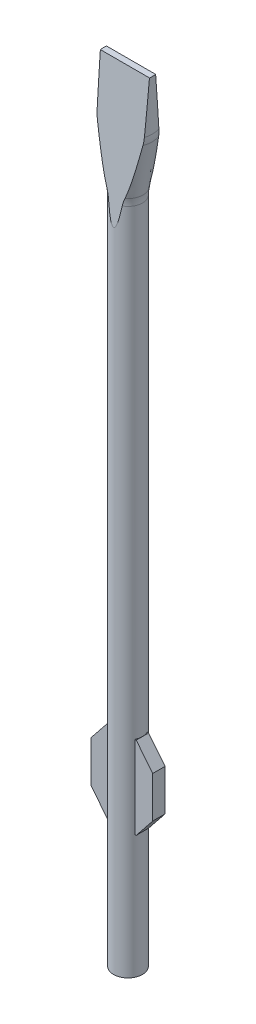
ISO-10303-21;
HEADER;
FILE_DESCRIPTION(('STEP AP214'),'2;1');
FILE_NAME('part.step','',(''),(''),'','','');
FILE_SCHEMA(('AUTOMOTIVE_DESIGN { 1 0 10303 214 1 1 1 1 }'));
ENDSEC;
DATA;
#1=APPLICATION_CONTEXT('core data for automotive mechanical design processes');
#2=APPLICATION_PROTOCOL_DEFINITION('international standard','automotive_design',2000,#1);
#3=PRODUCT_CONTEXT('',#1,'mechanical');
#4=PRODUCT('Part','Part','',(#3));
#5=PRODUCT_RELATED_PRODUCT_CATEGORY('part','',(#4));
#6=PRODUCT_DEFINITION_FORMATION('','',#4);
#7=PRODUCT_DEFINITION_CONTEXT('part definition',#1,'design');
#8=PRODUCT_DEFINITION('design','',#6,#7);
#9=PRODUCT_DEFINITION_SHAPE('','',#8);
#10=(LENGTH_UNIT() NAMED_UNIT(*) SI_UNIT(.MILLI.,.METRE.));
#11=(NAMED_UNIT(*) PLANE_ANGLE_UNIT() SI_UNIT($,.RADIAN.));
#12=(NAMED_UNIT(*) SI_UNIT($,.STERADIAN.) SOLID_ANGLE_UNIT());
#13=UNCERTAINTY_MEASURE_WITH_UNIT(LENGTH_MEASURE(1.E-05),#10,'distance_accuracy_value','');
#14=(GEOMETRIC_REPRESENTATION_CONTEXT(3) GLOBAL_UNCERTAINTY_ASSIGNED_CONTEXT((#13)) GLOBAL_UNIT_ASSIGNED_CONTEXT((#10,
#11,#12)) REPRESENTATION_CONTEXT('',''));
#15=CARTESIAN_POINT('',(0.,0.,0.));
#16=DIRECTION('',(0.,0.,1.));
#17=DIRECTION('',(1.,0.,0.));
#18=AXIS2_PLACEMENT_3D('',#15,#16,#17);
#19=CARTESIAN_POINT('',(0.,30.,0.));
#20=DIRECTION('',(0.,-1.,0.));
#21=DIRECTION('',(0.,0.,-1.));
#22=AXIS2_PLACEMENT_3D('',#19,#20,#21);
#23=CYLINDRICAL_SURFACE('',#22,3.50000000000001);
#24=CARTESIAN_POINT('',(0.,229.,0.));
#25=DIRECTION('',(0.,-0.08304547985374,0.99654575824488));
#26=DIRECTION('',(0.,-0.99654575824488,-0.08304547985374));
#27=AXIS2_PLACEMENT_3D('',#24,#25,#26);
#28=ELLIPSE('',#27,42.1455810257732,3.50000000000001);
#29=CARTESIAN_POINT('',(1.67380559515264,192.114149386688,-3.07382088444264));
#30=VERTEX_POINT('',#29);
#31=CARTESIAN_POINT('',(-1.67380559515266,192.114149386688,-3.07382088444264));
#32=VERTEX_POINT('',#31);
#33=EDGE_CURVE('E439',#30,#32,#28,.F.);
#34=ORIENTED_EDGE('',*,*,#33,.F.);
#35=CARTESIAN_POINT('',(0.,192.114149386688,0.));
#36=DIRECTION('',(0.,-1.,0.));
#37=DIRECTION('',(0.,0.,-1.));
#38=AXIS2_PLACEMENT_3D('',#35,#36,#37);
#39=CIRCLE('',#38,3.5);
#40=CARTESIAN_POINT('',(1.67380559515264,192.114149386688,3.07382088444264));
#41=VERTEX_POINT('',#40);
#42=EDGE_CURVE('E230',#30,#41,#39,.T.);
#43=ORIENTED_EDGE('',*,*,#42,.T.);
#44=CARTESIAN_POINT('',(0.,229.,0.));
#45=DIRECTION('',(0.,0.08304547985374,0.99654575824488));
#46=DIRECTION('',(0.,-0.99654575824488,0.08304547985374));
#47=AXIS2_PLACEMENT_3D('',#44,#45,#46);
#48=ELLIPSE('',#47,42.1455810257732,3.50000000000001);
#49=CARTESIAN_POINT('',(-1.67380559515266,192.114149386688,3.07382088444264));
#50=VERTEX_POINT('',#49);
#51=EDGE_CURVE('E468',#41,#50,#48,.F.);
#52=ORIENTED_EDGE('',*,*,#51,.T.);
#53=EDGE_CURVE('E229',#50,#32,#39,.T.);
#54=ORIENTED_EDGE('',*,*,#53,.T.);
#55=EDGE_LOOP('',(#34,#43,#52,#54));
#56=FACE_BOUND('',#55,.T.);
#57=CARTESIAN_POINT('',(0.,30.,0.));
#58=DIRECTION('',(0.,-1.,0.));
#59=DIRECTION('',(0.,0.,-1.));
#60=AXIS2_PLACEMENT_3D('',#57,#58,#59);
#61=CIRCLE('',#60,3.50000000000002);
#62=CARTESIAN_POINT('',(0.,30.,-3.50000000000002));
#63=VERTEX_POINT('',#62);
#64=EDGE_CURVE('E233',#63,#63,#61,.T.);
#65=ORIENTED_EDGE('',*,*,#64,.F.);
#66=EDGE_LOOP('',(#65));
#67=FACE_BOUND('',#66,.T.);
#68=CARTESIAN_POINT('',(0.,80.,0.));
#69=DIRECTION('',(0.,-1.,0.));
#70=DIRECTION('',(0.,0.,-1.));
#71=AXIS2_PLACEMENT_3D('',#68,#69,#70);
#72=CIRCLE('',#71,3.50000000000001);
#73=CARTESIAN_POINT('',(-3.16227766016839,80.,-1.5));
#74=VERTEX_POINT('',#73);
#75=CARTESIAN_POINT('',(-3.50000000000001,80.,0.));
#76=VERTEX_POINT('',#75);
#77=EDGE_CURVE('E243',#74,#76,#72,.F.);
#78=ORIENTED_EDGE('',*,*,#77,.T.);
#79=CARTESIAN_POINT('',(-3.16227766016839,80.,1.5));
#80=VERTEX_POINT('',#79);
#81=EDGE_CURVE('E247',#76,#80,#72,.F.);
#82=ORIENTED_EDGE('',*,*,#81,.T.);
#83=DIRECTION('',(0.,-1.,0.));
#84=VECTOR('',#83,1.);
#85=CARTESIAN_POINT('',(-3.16227766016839,30.,1.5));
#86=LINE('',#85,#84);
#87=CARTESIAN_POINT('',(-3.16227766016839,60.,1.5));
#88=VERTEX_POINT('',#87);
#89=EDGE_CURVE('E245',#80,#88,#86,.T.);
#90=ORIENTED_EDGE('',*,*,#89,.T.);
#91=CARTESIAN_POINT('',(0.,60.,0.));
#92=DIRECTION('',(0.,1.,0.));
#93=DIRECTION('',(0.,0.,1.));
#94=AXIS2_PLACEMENT_3D('',#91,#92,#93);
#95=CIRCLE('',#94,3.50000000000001);
#96=CARTESIAN_POINT('',(-3.50000000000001,60.,0.));
#97=VERTEX_POINT('',#96);
#98=EDGE_CURVE('E241',#88,#97,#95,.F.);
#99=ORIENTED_EDGE('',*,*,#98,.T.);
#100=CARTESIAN_POINT('',(-3.16227766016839,60.,-1.5));
#101=VERTEX_POINT('',#100);
#102=EDGE_CURVE('E239',#97,#101,#95,.F.);
#103=ORIENTED_EDGE('',*,*,#102,.T.);
#104=DIRECTION('',(0.,-1.,0.));
#105=VECTOR('',#104,1.);
#106=CARTESIAN_POINT('',(-3.16227766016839,30.,-1.5));
#107=LINE('',#106,#105);
#108=EDGE_CURVE('E236',#74,#101,#107,.T.);
#109=ORIENTED_EDGE('',*,*,#108,.F.);
#110=EDGE_LOOP('',(#78,#82,#90,#99,#103,#109));
#111=FACE_BOUND('',#110,.T.);
#112=CARTESIAN_POINT('',(3.16227766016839,60.,-1.5));
#113=VERTEX_POINT('',#112);
#114=CARTESIAN_POINT('',(3.50000000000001,60.,0.));
#115=VERTEX_POINT('',#114);
#116=EDGE_CURVE('E252',#113,#115,#95,.F.);
#117=ORIENTED_EDGE('',*,*,#116,.T.);
#118=CARTESIAN_POINT('',(3.16227766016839,60.,1.5));
#119=VERTEX_POINT('',#118);
#120=EDGE_CURVE('E242',#115,#119,#95,.F.);
#121=ORIENTED_EDGE('',*,*,#120,.T.);
#122=DIRECTION('',(0.,-1.,0.));
#123=VECTOR('',#122,1.);
#124=CARTESIAN_POINT('',(3.16227766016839,30.,1.5));
#125=LINE('',#124,#123);
#126=CARTESIAN_POINT('',(3.16227766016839,80.,1.5));
#127=VERTEX_POINT('',#126);
#128=EDGE_CURVE('E253',#119,#127,#125,.F.);
#129=ORIENTED_EDGE('',*,*,#128,.T.);
#130=CARTESIAN_POINT('',(3.50000000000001,80.,0.));
#131=VERTEX_POINT('',#130);
#132=EDGE_CURVE('E246',#127,#131,#72,.F.);
#133=ORIENTED_EDGE('',*,*,#132,.T.);
#134=CARTESIAN_POINT('',(3.16227766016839,80.,-1.5));
#135=VERTEX_POINT('',#134);
#136=EDGE_CURVE('E259',#131,#135,#72,.F.);
#137=ORIENTED_EDGE('',*,*,#136,.T.);
#138=DIRECTION('',(0.,-1.,0.));
#139=VECTOR('',#138,1.);
#140=CARTESIAN_POINT('',(3.16227766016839,30.,-1.5));
#141=LINE('',#140,#139);
#142=EDGE_CURVE('E249',#113,#135,#141,.F.);
#143=ORIENTED_EDGE('',*,*,#142,.F.);
#144=EDGE_LOOP('',(#117,#121,#129,#133,#137,#143));
#145=FACE_BOUND('',#144,.T.);
#146=ADVANCED_FACE('F33',(#56,#67,#111,#145),#23,.T.);
#147=CARTESIAN_POINT('',(0.,220.,0.));
#148=DIRECTION('',(0.,1.,0.));
#149=DIRECTION('',(0.,0.,1.));
#150=AXIS2_PLACEMENT_3D('',#147,#148,#149);
#151=PLANE('',#150);
#152=DIRECTION('',(1.,0.,0.));
#153=VECTOR('',#152,1.);
#154=CARTESIAN_POINT('',(-10.,220.,-0.750000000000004));
#155=LINE('',#154,#153);
#156=CARTESIAN_POINT('',(-5.95294044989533,220.,-0.750000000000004));
#157=VERTEX_POINT('',#156);
#158=CARTESIAN_POINT('',(5.95294044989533,220.,-0.750000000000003));
#159=VERTEX_POINT('',#158);
#160=EDGE_CURVE('E55',#157,#159,#155,.T.);
#161=ORIENTED_EDGE('',*,*,#160,.F.);
#162=CARTESIAN_POINT('',(0.,220.,0.));
#163=DIRECTION('',(0.,-1.,0.));
#164=DIRECTION('',(0.,0.,-1.));
#165=AXIS2_PLACEMENT_3D('',#162,#163,#164);
#166=CIRCLE('',#165,6.);
#167=CARTESIAN_POINT('',(-5.95294044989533,220.,0.75));
#168=VERTEX_POINT('',#167);
#169=EDGE_CURVE('E207',#168,#157,#166,.T.);
#170=ORIENTED_EDGE('',*,*,#169,.F.);
#171=DIRECTION('',(1.,0.,0.));
#172=VECTOR('',#171,1.);
#173=CARTESIAN_POINT('',(-10.,220.,0.75));
#174=LINE('',#173,#172);
#175=CARTESIAN_POINT('',(5.95294044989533,220.,0.75));
#176=VERTEX_POINT('',#175);
#177=EDGE_CURVE('E191',#168,#176,#174,.T.);
#178=ORIENTED_EDGE('',*,*,#177,.T.);
#179=EDGE_CURVE('E210',#159,#176,#166,.T.);
#180=ORIENTED_EDGE('',*,*,#179,.F.);
#181=EDGE_LOOP('',(#161,#170,#178,#180));
#182=FACE_BOUND('',#181,.T.);
#183=ADVANCED_FACE('F35',(#182),#151,.T.);
#184=CARTESIAN_POINT('',(0.,192.114149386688,0.));
#185=DIRECTION('',(0.,-1.,0.));
#186=DIRECTION('',(0.,0.,-1.));
#187=AXIS2_PLACEMENT_3D('',#184,#185,#186);
#188=TOROIDAL_SURFACE('',#187,13.5,10.);
#189=CARTESIAN_POINT('',(2.18984593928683,193.872255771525,-2.92731201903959));
#190=CARTESIAN_POINT('',(2.1318202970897,193.730376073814,-2.93913532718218));
#191=CARTESIAN_POINT('',(2.07647996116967,193.587339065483,-2.95105507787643));
#192=CARTESIAN_POINT('',(1.97285246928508,193.299310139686,-2.9750574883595));
#193=CARTESIAN_POINT('',(1.92454200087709,193.154326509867,-2.98713945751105));
#194=CARTESIAN_POINT('',(1.83622992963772,192.861760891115,-3.01151992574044));
#195=CARTESIAN_POINT('',(1.79623067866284,192.71417817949,-3.02381848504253));
#196=CARTESIAN_POINT('',(1.72659898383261,192.416097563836,-3.048658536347));
#197=CARTESIAN_POINT('',(1.69700236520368,192.26559143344,-3.06120071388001));
#198=CARTESIAN_POINT('',(1.67377499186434,192.113949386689,-3.07383755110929));
#199=B_SPLINE_CURVE_WITH_KNOTS('',3,(#189,#190,#191,#192,#193,#194,#195,#196,#197,#198),
.UNSPECIFIED.,.F.,.F.,(4,2,2,2,4),(0.,0.461285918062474,0.92100544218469,1.38085487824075,
1.84227280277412),.UNSPECIFIED.);
#200=CARTESIAN_POINT('',(2.18976403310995,193.872055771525,-2.92732868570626));
#201=VERTEX_POINT('',#200);
#202=EDGE_CURVE('E427',#201,#30,#199,.T.);
#203=ORIENTED_EDGE('',*,*,#202,.F.);
#204=CARTESIAN_POINT('',(0.,193.872055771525,0.));
#205=DIRECTION('',(0.,-1.,0.));
#206=DIRECTION('',(0.,0.,-1.));
#207=AXIS2_PLACEMENT_3D('',#204,#205,#206);
#208=CIRCLE('',#207,3.65572424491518);
#209=CARTESIAN_POINT('',(2.18976403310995,193.872055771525,2.92732868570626));
#210=VERTEX_POINT('',#209);
#211=EDGE_CURVE('E226',#201,#210,#208,.T.);
#212=ORIENTED_EDGE('',*,*,#211,.T.);
#213=CARTESIAN_POINT('',(2.18984593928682,193.872255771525,2.92731201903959));
#214=CARTESIAN_POINT('',(2.1318202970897,193.730376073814,2.93913532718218));
#215=CARTESIAN_POINT('',(2.07647996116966,193.587339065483,2.95105507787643));
#216=CARTESIAN_POINT('',(1.97285246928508,193.299310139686,2.9750574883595));
#217=CARTESIAN_POINT('',(1.92454200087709,193.154326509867,2.98713945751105));
#218=CARTESIAN_POINT('',(1.83622992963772,192.861760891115,3.01151992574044));
#219=CARTESIAN_POINT('',(1.79623067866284,192.71417817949,3.02381848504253));
#220=CARTESIAN_POINT('',(1.72659898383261,192.416097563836,3.048658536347));
#221=CARTESIAN_POINT('',(1.69700236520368,192.26559143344,3.06120071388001));
#222=CARTESIAN_POINT('',(1.67377499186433,192.113949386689,3.07383755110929));
#223=B_SPLINE_CURVE_WITH_KNOTS('',3,(#213,#214,#215,#216,#217,#218,#219,#220,#221,#222),
.UNSPECIFIED.,.F.,.F.,(4,2,2,2,4),(0.,0.461285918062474,0.92100544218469,1.38085487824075,
1.84227280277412),.UNSPECIFIED.);
#224=EDGE_CURVE('E451',#210,#41,#223,.T.);
#225=ORIENTED_EDGE('',*,*,#224,.T.);
#226=ORIENTED_EDGE('',*,*,#42,.F.);
#227=EDGE_LOOP('',(#203,#212,#225,#226));
#228=FACE_BOUND('',#227,.T.);
#229=ADVANCED_FACE('F440',(#228),#188,.F.);
#230=CARTESIAN_POINT('',(-1.6737749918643,192.113949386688,-3.0738375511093));
#231=CARTESIAN_POINT('',(-1.69700236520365,192.26559143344,-3.06120071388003));
#232=CARTESIAN_POINT('',(-1.72659898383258,192.416097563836,-3.04865853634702));
#233=CARTESIAN_POINT('',(-1.79623067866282,192.71417817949,-3.02381848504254));
#234=CARTESIAN_POINT('',(-1.8362299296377,192.861760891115,-3.01151992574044));
#235=CARTESIAN_POINT('',(-1.92454200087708,193.154326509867,-2.98713945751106));
#236=CARTESIAN_POINT('',(-1.97285246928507,193.299310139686,-2.9750574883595));
#237=CARTESIAN_POINT('',(-2.07647996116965,193.587339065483,-2.95105507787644));
#238=CARTESIAN_POINT('',(-2.13182029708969,193.730376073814,-2.93913532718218));
#239=CARTESIAN_POINT('',(-2.18984593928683,193.872255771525,-2.92731201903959));
#240=B_SPLINE_CURVE_WITH_KNOTS('',3,(#230,#231,#232,#233,#234,#235,#236,#237,#238,#239),
.UNSPECIFIED.,.F.,.F.,(4,2,2,2,4),(0.,0.461417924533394,0.921267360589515,1.38098688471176,
1.84227280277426),.UNSPECIFIED.);
#241=CARTESIAN_POINT('',(-2.18976403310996,193.872055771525,-2.92732868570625));
#242=VERTEX_POINT('',#241);
#243=EDGE_CURVE('E434',#32,#242,#240,.T.);
#244=ORIENTED_EDGE('',*,*,#243,.F.);
#245=ORIENTED_EDGE('',*,*,#53,.F.);
#246=CARTESIAN_POINT('',(-1.67377499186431,192.113949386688,3.0738375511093));
#247=CARTESIAN_POINT('',(-1.69700236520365,192.26559143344,3.06120071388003));
#248=CARTESIAN_POINT('',(-1.72659898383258,192.416097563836,3.04865853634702));
#249=CARTESIAN_POINT('',(-1.79623067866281,192.71417817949,3.02381848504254));
#250=CARTESIAN_POINT('',(-1.83622992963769,192.861760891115,3.01151992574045));
#251=CARTESIAN_POINT('',(-1.92454200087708,193.154326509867,2.98713945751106));
#252=CARTESIAN_POINT('',(-1.97285246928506,193.299310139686,2.9750574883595));
#253=CARTESIAN_POINT('',(-2.07647996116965,193.587339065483,2.95105507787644));
#254=CARTESIAN_POINT('',(-2.1318202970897,193.730376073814,2.93913532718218));
#255=CARTESIAN_POINT('',(-2.18984593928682,193.872255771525,2.92731201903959));
#256=B_SPLINE_CURVE_WITH_KNOTS('',3,(#246,#247,#248,#249,#250,#251,#252,#253,#254,#255),
.UNSPECIFIED.,.F.,.F.,(4,2,2,2,4),(0.,0.461417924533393,0.921267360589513,1.38098688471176,
1.84227280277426),.UNSPECIFIED.);
#257=CARTESIAN_POINT('',(-2.18976403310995,193.872055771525,2.92732868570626));
#258=VERTEX_POINT('',#257);
#259=EDGE_CURVE('E460',#50,#258,#256,.T.);
#260=ORIENTED_EDGE('',*,*,#259,.T.);
#261=EDGE_CURVE('E225',#258,#242,#208,.T.);
#262=ORIENTED_EDGE('',*,*,#261,.T.);
#263=EDGE_LOOP('',(#244,#245,#260,#262));
#264=FACE_BOUND('',#263,.T.);
#265=ADVANCED_FACE('F444',(#264),#188,.F.);
#266=CARTESIAN_POINT('',(0.,193.872055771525,0.));
#267=DIRECTION('',(0.,1.,0.));
#268=DIRECTION('',(0.,0.,1.));
#269=AXIS2_PLACEMENT_3D('',#266,#267,#268);
#270=CONICAL_SURFACE('',#269,3.65572424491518,0.176708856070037);
#271=CARTESIAN_POINT('',(5.52477930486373,206.128144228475,-1.90598798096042));
#272=CARTESIAN_POINT('',(5.43678863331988,205.723928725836,-1.93967260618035));
#273=CARTESIAN_POINT('',(5.34787259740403,205.319911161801,-1.97334073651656));
#274=CARTESIAN_POINT('',(5.16783715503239,204.512354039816,-2.04063716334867));
#275=CARTESIAN_POINT('',(5.07671769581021,204.108814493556,-2.07426545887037));
#276=CARTESIAN_POINT('',(4.89185553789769,203.302003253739,-2.14149972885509));
#277=CARTESIAN_POINT('',(4.79811086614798,202.898732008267,-2.17510566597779));
#278=CARTESIAN_POINT('',(4.60759624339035,202.092901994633,-2.24225816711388));
#279=CARTESIAN_POINT('',(4.51082631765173,201.690343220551,-2.27580473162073));
#280=CARTESIAN_POINT('',(4.31400742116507,200.887545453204,-2.34270454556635));
#281=CARTESIAN_POINT('',(4.21397141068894,200.487303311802,-2.37605805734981));
#282=CARTESIAN_POINT('',(4.00949441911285,199.6879380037,-2.44267183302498));
#283=CARTESIAN_POINT('',(3.90505348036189,199.288814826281,-2.4759320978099));
#284=CARTESIAN_POINT('',(3.69068745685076,198.492148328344,-2.54232097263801));
#285=CARTESIAN_POINT('',(3.58076390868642,198.094604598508,-2.57544961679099));
#286=CARTESIAN_POINT('',(3.35383271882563,197.301525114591,-2.6415395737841));
#287=CARTESIAN_POINT('',(3.23682530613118,196.905989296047,-2.67450089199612));
#288=CARTESIAN_POINT('',(3.04622907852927,196.289242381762,-2.72589646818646));
#289=CARTESIAN_POINT('',(2.97589030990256,196.06703485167,-2.7444137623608));
#290=CARTESIAN_POINT('',(2.8315026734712,195.623823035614,-2.78134808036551));
#291=CARTESIAN_POINT('',(2.75745391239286,195.402818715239,-2.79976510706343));
#292=CARTESIAN_POINT('',(2.60470377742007,194.962177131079,-2.83648523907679));
#293=CARTESIAN_POINT('',(2.52599826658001,194.742541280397,-2.85478822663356));
#294=CARTESIAN_POINT('',(2.40353638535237,194.414687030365,-2.88210941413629));
#295=CARTESIAN_POINT('',(2.36197581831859,194.305654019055,-2.89119549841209));
#296=CARTESIAN_POINT('',(2.27715808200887,194.088237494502,-2.90931354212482));
#297=CARTESIAN_POINT('',(2.23390079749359,193.979854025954,-2.91834549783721));
#298=CARTESIAN_POINT('',(2.18968212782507,193.871855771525,-2.92734535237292));
#299=B_SPLINE_CURVE_WITH_KNOTS('',3,(#271,#272,#273,#274,#275,#276,#277,#278,#279,#280,#281,
#282,#283,#284,#285,#286,#287,#288,#289,#290,#291,#292,#293,#294,#295,#296,#297,#298),
.UNSPECIFIED.,.F.,.F.,(4,2,2,2,2,2,2,2,2,2,2,2,2,4),(0.,1.24515446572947,2.49033877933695,
3.73648549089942,4.98262179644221,6.22430288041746,7.46597202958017,8.70729511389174,
9.94857809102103,10.6499793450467,11.3513604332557,12.0533742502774,12.4044775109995,
12.7556046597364),.UNSPECIFIED.);
#300=CARTESIAN_POINT('',(5.5247357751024,206.127944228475,-1.90600464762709));
#301=VERTEX_POINT('',#300);
#302=EDGE_CURVE('E420',#301,#201,#299,.T.);
#303=ORIENTED_EDGE('',*,*,#302,.F.);
#304=CARTESIAN_POINT('',(0.,206.127944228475,0.));
#305=DIRECTION('',(0.,-1.,0.));
#306=DIRECTION('',(0.,0.,-1.));
#307=AXIS2_PLACEMENT_3D('',#304,#305,#306);
#308=CIRCLE('',#307,5.84427575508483);
#309=CARTESIAN_POINT('',(5.5247357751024,206.127944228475,1.90600464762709));
#310=VERTEX_POINT('',#309);
#311=EDGE_CURVE('E222',#301,#310,#308,.T.);
#312=ORIENTED_EDGE('',*,*,#311,.T.);
#313=CARTESIAN_POINT('',(5.52477930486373,206.128144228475,1.90598798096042));
#314=CARTESIAN_POINT('',(5.43678863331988,205.723928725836,1.93967260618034));
#315=CARTESIAN_POINT('',(5.34787259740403,205.319911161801,1.97334073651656));
#316=CARTESIAN_POINT('',(5.16783715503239,204.512354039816,2.04063716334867));
#317=CARTESIAN_POINT('',(5.07671769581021,204.108814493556,2.07426545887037));
#318=CARTESIAN_POINT('',(4.89185553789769,203.302003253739,2.14149972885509));
#319=CARTESIAN_POINT('',(4.79811086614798,202.898732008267,2.17510566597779));
#320=CARTESIAN_POINT('',(4.60759624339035,202.092901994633,2.24225816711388));
#321=CARTESIAN_POINT('',(4.51082631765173,201.690343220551,2.27580473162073));
#322=CARTESIAN_POINT('',(4.31400742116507,200.887545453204,2.34270454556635));
#323=CARTESIAN_POINT('',(4.21397141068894,200.487303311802,2.37605805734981));
#324=CARTESIAN_POINT('',(4.00949441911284,199.6879380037,2.44267183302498));
#325=CARTESIAN_POINT('',(3.90505348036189,199.288814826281,2.4759320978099));
#326=CARTESIAN_POINT('',(3.69068745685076,198.492148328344,2.542320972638));
#327=CARTESIAN_POINT('',(3.58076390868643,198.094604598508,2.57544961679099));
#328=CARTESIAN_POINT('',(3.35383271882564,197.301525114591,2.6415395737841));
#329=CARTESIAN_POINT('',(3.23682530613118,196.905989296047,2.67450089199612));
#330=CARTESIAN_POINT('',(3.04622907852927,196.289242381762,2.72589646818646));
#331=CARTESIAN_POINT('',(2.97589030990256,196.06703485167,2.7444137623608));
#332=CARTESIAN_POINT('',(2.8315026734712,195.623823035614,2.78134808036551));
#333=CARTESIAN_POINT('',(2.75745391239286,195.402818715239,2.79976510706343));
#334=CARTESIAN_POINT('',(2.60470377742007,194.962177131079,2.83648523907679));
#335=CARTESIAN_POINT('',(2.52599826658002,194.742541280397,2.85478822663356));
#336=CARTESIAN_POINT('',(2.40353638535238,194.414687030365,2.88210941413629));
#337=CARTESIAN_POINT('',(2.36197581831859,194.305654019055,2.89119549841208));
#338=CARTESIAN_POINT('',(2.27715808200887,194.088237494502,2.90931354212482));
#339=CARTESIAN_POINT('',(2.23390079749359,193.979854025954,2.91834549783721));
#340=CARTESIAN_POINT('',(2.18968212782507,193.871855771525,2.92734535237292));
#341=B_SPLINE_CURVE_WITH_KNOTS('',3,(#313,#314,#315,#316,#317,#318,#319,#320,#321,#322,#323,
#324,#325,#326,#327,#328,#329,#330,#331,#332,#333,#334,#335,#336,#337,#338,#339,#340),
.UNSPECIFIED.,.F.,.F.,(4,2,2,2,2,2,2,2,2,2,2,2,2,4),(0.,1.24515446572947,2.49033877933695,
3.73648549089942,4.98262179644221,6.22430288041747,7.46597202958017,8.70729511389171,
9.94857809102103,10.6499793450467,11.3513604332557,12.0533742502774,12.4044775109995,
12.7556046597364),.UNSPECIFIED.);
#342=EDGE_CURVE('E756',#310,#210,#341,.T.);
#343=ORIENTED_EDGE('',*,*,#342,.T.);
#344=ORIENTED_EDGE('',*,*,#211,.F.);
#345=EDGE_LOOP('',(#303,#312,#343,#344));
#346=FACE_BOUND('',#345,.T.);
#347=ADVANCED_FACE('F446',(#346),#270,.T.);
#348=CARTESIAN_POINT('',(-2.18968212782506,193.871855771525,-2.92734535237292));
#349=CARTESIAN_POINT('',(-2.2389104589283,193.992104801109,-2.91732459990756));
#350=CARTESIAN_POINT('',(-2.28695480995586,194.11282816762,-2.90726431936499));
#351=CARTESIAN_POINT('',(-2.38097166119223,194.355063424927,-2.88707804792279));
#352=CARTESIAN_POINT('',(-2.42694432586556,194.47657525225,-2.87695206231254));
#353=CARTESIAN_POINT('',(-2.51710834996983,194.720210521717,-2.85664912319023));
#354=CARTESIAN_POINT('',(-2.5613002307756,194.842333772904,-2.84647218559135));
#355=CARTESIAN_POINT('',(-2.6481386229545,195.087126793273,-2.82607276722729));
#356=CARTESIAN_POINT('',(-2.69078509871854,195.209796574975,-2.81585028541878));
#357=CARTESIAN_POINT('',(-2.81662593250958,195.578298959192,-2.78514175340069));
#358=CARTESIAN_POINT('',(-2.89779317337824,195.824819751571,-2.76459835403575));
#359=CARTESIAN_POINT('',(-3.0558436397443,196.319236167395,-2.72339698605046));
#360=CARTESIAN_POINT('',(-3.13272648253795,196.567131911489,-2.70273900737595));
#361=CARTESIAN_POINT('',(-3.28288539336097,197.063629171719,-2.66136423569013));
#362=CARTESIAN_POINT('',(-3.35616630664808,197.312229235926,-2.64064756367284));
#363=CARTESIAN_POINT('',(-3.49981367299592,197.810252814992,-2.59914559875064));
#364=CARTESIAN_POINT('',(-3.57018021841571,198.059676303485,-2.57836030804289));
#365=CARTESIAN_POINT('',(-3.77763910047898,198.809071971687,-2.51591066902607));
#366=CARTESIAN_POINT('',(-3.91105650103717,199.310054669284,-2.474162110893));
#367=CARTESIAN_POINT('',(-4.17612587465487,200.335162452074,-2.38873646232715));
#368=CARTESIAN_POINT('',(-4.30746287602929,200.859367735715,-2.3450526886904));
#369=CARTESIAN_POINT('',(-4.56404600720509,201.909200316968,-2.25756664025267));
#370=CARTESIAN_POINT('',(-4.68929270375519,202.43482747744,-2.21376437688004));
#371=CARTESIAN_POINT('',(-4.93514910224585,203.487890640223,-2.12600911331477));
#372=CARTESIAN_POINT('',(-5.055752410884,204.015328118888,-2.08205599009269));
#373=CARTESIAN_POINT('',(-5.29301258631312,205.071115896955,-1.99407367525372));
#374=CARTESIAN_POINT('',(-5.40966923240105,205.599466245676,-1.95004447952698));
#375=CARTESIAN_POINT('',(-5.52477930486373,206.128144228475,-1.90598798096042));
#376=B_SPLINE_CURVE_WITH_KNOTS('',3,(#348,#349,#350,#351,#352,#353,#354,#355,#356,#357,#358,
#359,#360,#361,#362,#363,#364,#365,#366,#367,#368,#369,#370,#371,#372,#373,#374,#375),
.UNSPECIFIED.,.F.,.F.,(4,2,2,2,2,2,2,2,2,2,2,2,2,4),(0.,0.39094853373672,0.781865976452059,
1.17266812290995,1.5634792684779,2.34447631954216,3.12554302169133,3.90552855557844,
4.68548935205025,6.24577102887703,7.87224026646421,9.49855785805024,11.1270399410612,
12.7556129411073),.UNSPECIFIED.);
#377=CARTESIAN_POINT('',(-5.5247357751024,206.127944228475,-1.90600464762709));
#378=VERTEX_POINT('',#377);
#379=EDGE_CURVE('E392',#242,#378,#376,.T.);
#380=ORIENTED_EDGE('',*,*,#379,.F.);
#381=ORIENTED_EDGE('',*,*,#261,.F.);
#382=CARTESIAN_POINT('',(-2.18968212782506,193.871855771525,2.92734535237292));
#383=CARTESIAN_POINT('',(-2.2389104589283,193.992104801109,2.91732459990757));
#384=CARTESIAN_POINT('',(-2.28695480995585,194.11282816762,2.90726431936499));
#385=CARTESIAN_POINT('',(-2.38097166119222,194.355063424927,2.88707804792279));
#386=CARTESIAN_POINT('',(-2.42694432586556,194.47657525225,2.87695206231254));
#387=CARTESIAN_POINT('',(-2.51710834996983,194.720210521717,2.85664912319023));
#388=CARTESIAN_POINT('',(-2.5613002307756,194.842333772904,2.84647218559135));
#389=CARTESIAN_POINT('',(-2.6481386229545,195.087126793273,2.82607276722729));
#390=CARTESIAN_POINT('',(-2.69078509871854,195.209796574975,2.81585028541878));
#391=CARTESIAN_POINT('',(-2.81662593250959,195.578298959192,2.78514175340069));
#392=CARTESIAN_POINT('',(-2.89779317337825,195.824819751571,2.76459835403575));
#393=CARTESIAN_POINT('',(-3.05584363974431,196.319236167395,2.72339698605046));
#394=CARTESIAN_POINT('',(-3.13272648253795,196.567131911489,2.70273900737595));
#395=CARTESIAN_POINT('',(-3.28288539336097,197.063629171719,2.66136423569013));
#396=CARTESIAN_POINT('',(-3.35616630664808,197.312229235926,2.64064756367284));
#397=CARTESIAN_POINT('',(-3.49981367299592,197.810252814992,2.59914559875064));
#398=CARTESIAN_POINT('',(-3.57018021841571,198.059676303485,2.57836030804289));
#399=CARTESIAN_POINT('',(-3.77763910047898,198.809071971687,2.51591066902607));
#400=CARTESIAN_POINT('',(-3.91105650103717,199.310054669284,2.474162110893));
#401=CARTESIAN_POINT('',(-4.17612587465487,200.335162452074,2.38873646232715));
#402=CARTESIAN_POINT('',(-4.30746287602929,200.859367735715,2.34505268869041));
#403=CARTESIAN_POINT('',(-4.56404600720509,201.909200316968,2.25756664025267));
#404=CARTESIAN_POINT('',(-4.68929270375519,202.43482747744,2.21376437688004));
#405=CARTESIAN_POINT('',(-4.93514910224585,203.487890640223,2.12600911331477));
#406=CARTESIAN_POINT('',(-5.055752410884,204.015328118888,2.08205599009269));
#407=CARTESIAN_POINT('',(-5.29301258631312,205.071115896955,1.99407367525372));
#408=CARTESIAN_POINT('',(-5.40966923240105,205.599466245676,1.95004447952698));
#409=CARTESIAN_POINT('',(-5.52477930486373,206.128144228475,1.90598798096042));
#410=B_SPLINE_CURVE_WITH_KNOTS('',3,(#382,#383,#384,#385,#386,#387,#388,#389,#390,#391,#392,
#393,#394,#395,#396,#397,#398,#399,#400,#401,#402,#403,#404,#405,#406,#407,#408,#409),
.UNSPECIFIED.,.F.,.F.,(4,2,2,2,2,2,2,2,2,2,2,2,2,4),(0.,0.39094853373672,0.78186597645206,
1.17266812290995,1.5634792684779,2.34447631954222,3.12554302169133,3.90552855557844,
4.68548935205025,6.24577102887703,7.87224026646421,9.49855785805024,11.1270399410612,
12.7556129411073),.UNSPECIFIED.);
#411=CARTESIAN_POINT('',(-5.5247357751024,206.127944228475,1.90600464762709));
#412=VERTEX_POINT('',#411);
#413=EDGE_CURVE('E467',#258,#412,#410,.T.);
#414=ORIENTED_EDGE('',*,*,#413,.T.);
#415=EDGE_CURVE('E221',#412,#378,#308,.T.);
#416=ORIENTED_EDGE('',*,*,#415,.T.);
#417=EDGE_LOOP('',(#380,#381,#414,#416));
#418=FACE_BOUND('',#417,.T.);
#419=ADVANCED_FACE('F498',(#418),#270,.T.);
#420=CARTESIAN_POINT('',(0.,207.885850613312,0.));
#421=DIRECTION('',(0.,-1.,0.));
#422=DIRECTION('',(0.,0.,-1.));
#423=AXIS2_PLACEMENT_3D('',#420,#421,#422);
#424=DEGENERATE_TOROIDAL_SURFACE('',#423,4.,10.,.F.);
#425=CARTESIAN_POINT('',(5.73621604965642,207.886050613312,-1.75949578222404));
#426=CARTESIAN_POINT('',(5.72868223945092,207.590471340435,-1.78412738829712));
#427=CARTESIAN_POINT('',(5.70724503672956,207.295357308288,-1.80872022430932));
#428=CARTESIAN_POINT('',(5.65435603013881,206.85534805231,-1.84538766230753));
#429=CARTESIAN_POINT('',(5.6332838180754,206.70918181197,-1.85756818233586));
#430=CARTESIAN_POINT('',(5.58419851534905,206.417679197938,-1.88186006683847));
#431=CARTESIAN_POINT('',(5.55617017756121,206.27234537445,-1.89397121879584));
#432=CARTESIAN_POINT('',(5.524692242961,206.127744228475,-1.90602131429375));
#433=B_SPLINE_CURVE_WITH_KNOTS('',3,(#425,#426,#427,#428,#429,#430,#431,#432),.UNSPECIFIED.,.F.,
.F.,(4,2,2,4),(0.,0.889500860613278,1.33388400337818,1.77924992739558),.UNSPECIFIED.);
#434=CARTESIAN_POINT('',(5.73621093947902,207.885850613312,-1.75951244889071));
#435=VERTEX_POINT('',#434);
#436=EDGE_CURVE('E411',#435,#301,#433,.T.);
#437=ORIENTED_EDGE('',*,*,#436,.F.);
#438=CARTESIAN_POINT('',(0.,207.885850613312,0.));
#439=DIRECTION('',(0.,-1.,0.));
#440=DIRECTION('',(0.,0.,-1.));
#441=AXIS2_PLACEMENT_3D('',#438,#439,#440);
#442=CIRCLE('',#441,6.00000000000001);
#443=CARTESIAN_POINT('',(5.73621093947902,207.885850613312,1.75951244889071));
#444=VERTEX_POINT('',#443);
#445=EDGE_CURVE('E218',#435,#444,#442,.T.);
#446=ORIENTED_EDGE('',*,*,#445,.T.);
#447=CARTESIAN_POINT('',(5.73621604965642,207.886050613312,1.75949578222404));
#448=CARTESIAN_POINT('',(5.72868223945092,207.590471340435,1.78412738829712));
#449=CARTESIAN_POINT('',(5.70724503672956,207.295357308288,1.80872022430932));
#450=CARTESIAN_POINT('',(5.65435603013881,206.85534805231,1.84538766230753));
#451=CARTESIAN_POINT('',(5.6332838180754,206.70918181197,1.85756818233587));
#452=CARTESIAN_POINT('',(5.58419851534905,206.417679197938,1.88186006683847));
#453=CARTESIAN_POINT('',(5.55617017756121,206.27234537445,1.89397121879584));
#454=CARTESIAN_POINT('',(5.524692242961,206.127744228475,1.90602131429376));
#455=B_SPLINE_CURVE_WITH_KNOTS('',3,(#447,#448,#449,#450,#451,#452,#453,#454),.UNSPECIFIED.,.F.,
.F.,(4,2,2,4),(0.,0.889500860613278,1.33388400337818,1.77924992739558),.UNSPECIFIED.);
#456=EDGE_CURVE('E48',#444,#310,#455,.T.);
#457=ORIENTED_EDGE('',*,*,#456,.T.);
#458=ORIENTED_EDGE('',*,*,#311,.F.);
#459=EDGE_LOOP('',(#437,#446,#457,#458));
#460=FACE_BOUND('',#459,.T.);
#461=ADVANCED_FACE('F399',(#460),#424,.F.);
#462=CARTESIAN_POINT('',(-5.524692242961,206.127744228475,-1.90602131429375));
#463=CARTESIAN_POINT('',(-5.55617017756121,206.27234537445,-1.89397121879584));
#464=CARTESIAN_POINT('',(-5.58419851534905,206.417679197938,-1.88186006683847));
#465=CARTESIAN_POINT('',(-5.6332838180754,206.70918181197,-1.85756818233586));
#466=CARTESIAN_POINT('',(-5.65435603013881,206.85534805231,-1.84538766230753));
#467=CARTESIAN_POINT('',(-5.70724503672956,207.295357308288,-1.80872022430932));
#468=CARTESIAN_POINT('',(-5.72868223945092,207.590471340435,-1.78412738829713));
#469=CARTESIAN_POINT('',(-5.73621604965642,207.886050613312,-1.75949578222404));
#470=B_SPLINE_CURVE_WITH_KNOTS('',3,(#462,#463,#464,#465,#466,#467,#468,#469),.UNSPECIFIED.,.F.,
.F.,(4,2,2,4),(0.,0.445365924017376,0.889749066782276,1.77924992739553),.UNSPECIFIED.);
#471=CARTESIAN_POINT('',(-5.73621093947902,207.885850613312,-1.7595124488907));
#472=VERTEX_POINT('',#471);
#473=EDGE_CURVE('E314',#378,#472,#470,.T.);
#474=ORIENTED_EDGE('',*,*,#473,.F.);
#475=ORIENTED_EDGE('',*,*,#415,.F.);
#476=CARTESIAN_POINT('',(-5.524692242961,206.127744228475,1.90602131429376));
#477=CARTESIAN_POINT('',(-5.55617017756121,206.27234537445,1.89397121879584));
#478=CARTESIAN_POINT('',(-5.58419851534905,206.417679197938,1.88186006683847));
#479=CARTESIAN_POINT('',(-5.6332838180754,206.70918181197,1.85756818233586));
#480=CARTESIAN_POINT('',(-5.65435603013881,206.85534805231,1.84538766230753));
#481=CARTESIAN_POINT('',(-5.70724503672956,207.295357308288,1.80872022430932));
#482=CARTESIAN_POINT('',(-5.72868223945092,207.590471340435,1.78412738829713));
#483=CARTESIAN_POINT('',(-5.73621604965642,207.886050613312,1.75949578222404));
#484=B_SPLINE_CURVE_WITH_KNOTS('',3,(#476,#477,#478,#479,#480,#481,#482,#483),.UNSPECIFIED.,.F.,
.F.,(4,2,2,4),(0.,0.445365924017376,0.889749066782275,1.77924992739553),.UNSPECIFIED.);
#485=CARTESIAN_POINT('',(-5.73621093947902,207.885850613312,1.7595124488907));
#486=VERTEX_POINT('',#485);
#487=EDGE_CURVE('E474',#412,#486,#484,.T.);
#488=ORIENTED_EDGE('',*,*,#487,.T.);
#489=EDGE_CURVE('E209',#486,#472,#442,.T.);
#490=ORIENTED_EDGE('',*,*,#489,.T.);
#491=EDGE_LOOP('',(#474,#475,#488,#490));
#492=FACE_BOUND('',#491,.T.);
#493=ADVANCED_FACE('F501',(#492),#424,.F.);
#494=CARTESIAN_POINT('',(0.,30.,0.));
#495=DIRECTION('',(0.,-1.,0.));
#496=DIRECTION('',(0.,0.,-1.));
#497=AXIS2_PLACEMENT_3D('',#494,#495,#496);
#498=CYLINDRICAL_SURFACE('',#497,6.);
#499=CARTESIAN_POINT('',(0.,229.,0.));
#500=DIRECTION('',(0.,-0.08304547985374,0.99654575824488));
#501=DIRECTION('',(0.,-0.99654575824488,-0.08304547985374));
#502=AXIS2_PLACEMENT_3D('',#499,#500,#501);
#503=ELLIPSE('',#502,72.2495674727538,6.);
#504=EDGE_CURVE('E11',#472,#157,#503,.F.);
#505=ORIENTED_EDGE('',*,*,#504,.F.);
#506=ORIENTED_EDGE('',*,*,#489,.F.);
#507=CARTESIAN_POINT('',(0.,229.,0.));
#508=DIRECTION('',(0.,0.08304547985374,0.99654575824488));
#509=DIRECTION('',(0.,-0.99654575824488,0.08304547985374));
#510=AXIS2_PLACEMENT_3D('',#507,#508,#509);
#511=ELLIPSE('',#510,72.2495674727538,6.);
#512=EDGE_CURVE('E194',#486,#168,#511,.F.);
#513=ORIENTED_EDGE('',*,*,#512,.T.);
#514=ORIENTED_EDGE('',*,*,#169,.T.);
#515=EDGE_LOOP('',(#505,#506,#513,#514));
#516=FACE_BOUND('',#515,.T.);
#517=ADVANCED_FACE('F206',(#516),#498,.T.);
#518=EDGE_CURVE('E37',#159,#435,#503,.F.);
#519=ORIENTED_EDGE('',*,*,#518,.F.);
#520=ORIENTED_EDGE('',*,*,#179,.T.);
#521=EDGE_CURVE('E196',#176,#444,#511,.F.);
#522=ORIENTED_EDGE('',*,*,#521,.T.);
#523=ORIENTED_EDGE('',*,*,#445,.F.);
#524=EDGE_LOOP('',(#519,#520,#522,#523));
#525=FACE_BOUND('',#524,.T.);
#526=ADVANCED_FACE('F507',(#525),#498,.T.);
#527=CARTESIAN_POINT('',(0.,30.,-3.50000000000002));
#528=DIRECTION('',(0.,-1.,0.));
#529=DIRECTION('',(0.,0.,-1.));
#530=AXIS2_PLACEMENT_3D('',#527,#528,#529);
#531=PLANE('',#530);
#532=ORIENTED_EDGE('',*,*,#64,.T.);
#533=EDGE_LOOP('',(#532));
#534=FACE_BOUND('',#533,.T.);
#535=ADVANCED_FACE('F566',(#534),#531,.T.);
#536=CARTESIAN_POINT('',(-3.50000000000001,80.,1.5));
#537=DIRECTION('',(0.780868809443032,-0.624695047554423,0.));
#538=DIRECTION('',(0.624695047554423,0.780868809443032,0.));
#539=AXIS2_PLACEMENT_3D('',#536,#537,#538);
#540=PLANE('',#539);
#541=DIRECTION('',(-0.624695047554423,-0.780868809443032,0.));
#542=VECTOR('',#541,1.);
#543=CARTESIAN_POINT('',(-3.50000000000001,80.,-1.5));
#544=LINE('',#543,#542);
#545=CARTESIAN_POINT('',(-3.50000000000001,80.,-1.5));
#546=VERTEX_POINT('',#545);
#547=CARTESIAN_POINT('',(-7.5,75.,-1.5));
#548=VERTEX_POINT('',#547);
#549=EDGE_CURVE('E304',#546,#548,#544,.T.);
#550=ORIENTED_EDGE('',*,*,#549,.T.);
#551=DIRECTION('',(0.,0.,-1.));
#552=VECTOR('',#551,1.);
#553=CARTESIAN_POINT('',(-7.5,75.,1.5));
#554=LINE('',#553,#552);
#555=CARTESIAN_POINT('',(-7.5,75.,1.5));
#556=VERTEX_POINT('',#555);
#557=EDGE_CURVE('E290',#556,#548,#554,.T.);
#558=ORIENTED_EDGE('',*,*,#557,.F.);
#559=DIRECTION('',(-0.624695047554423,-0.780868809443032,0.));
#560=VECTOR('',#559,1.);
#561=CARTESIAN_POINT('',(-3.50000000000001,80.,1.5));
#562=LINE('',#561,#560);
#563=CARTESIAN_POINT('',(-3.50000000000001,80.,1.5));
#564=VERTEX_POINT('',#563);
#565=EDGE_CURVE('E380',#564,#556,#562,.T.);
#566=ORIENTED_EDGE('',*,*,#565,.F.);
#567=DIRECTION('',(0.,0.,-1.));
#568=VECTOR('',#567,1.);
#569=CARTESIAN_POINT('',(-3.50000000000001,80.,1.5));
#570=LINE('',#569,#568);
#571=EDGE_CURVE('E211',#564,#76,#570,.T.);
#572=ORIENTED_EDGE('',*,*,#571,.T.);
#573=EDGE_CURVE('E214',#76,#546,#570,.T.);
#574=ORIENTED_EDGE('',*,*,#573,.T.);
#575=EDGE_LOOP('',(#550,#558,#566,#572,#574));
#576=FACE_BOUND('',#575,.T.);
#577=ADVANCED_FACE('F302',(#576),#540,.F.);
#578=CARTESIAN_POINT('',(-7.5,75.,1.5));
#579=DIRECTION('',(1.,0.,0.));
#580=DIRECTION('',(0.,0.,-1.));
#581=AXIS2_PLACEMENT_3D('',#578,#579,#580);
#582=PLANE('',#581);
#583=DIRECTION('',(0.,-1.,0.));
#584=VECTOR('',#583,1.);
#585=CARTESIAN_POINT('',(-7.5,75.,-1.5));
#586=LINE('',#585,#584);
#587=CARTESIAN_POINT('',(-7.5,65.,-1.5));
#588=VERTEX_POINT('',#587);
#589=EDGE_CURVE('E317',#548,#588,#586,.T.);
#590=ORIENTED_EDGE('',*,*,#589,.T.);
#591=DIRECTION('',(0.,0.,-1.));
#592=VECTOR('',#591,1.);
#593=CARTESIAN_POINT('',(-7.5,65.,1.5));
#594=LINE('',#593,#592);
#595=CARTESIAN_POINT('',(-7.5,65.,1.5));
#596=VERTEX_POINT('',#595);
#597=EDGE_CURVE('E289',#596,#588,#594,.T.);
#598=ORIENTED_EDGE('',*,*,#597,.F.);
#599=DIRECTION('',(0.,-1.,0.));
#600=VECTOR('',#599,1.);
#601=CARTESIAN_POINT('',(-7.5,75.,1.5));
#602=LINE('',#601,#600);
#603=EDGE_CURVE('E378',#556,#596,#602,.T.);
#604=ORIENTED_EDGE('',*,*,#603,.F.);
#605=ORIENTED_EDGE('',*,*,#557,.T.);
#606=EDGE_LOOP('',(#590,#598,#604,#605));
#607=FACE_BOUND('',#606,.T.);
#608=ADVANCED_FACE('F580',(#607),#582,.F.);
#609=CARTESIAN_POINT('',(0.,0.,1.5));
#610=DIRECTION('',(0.,0.,-1.));
#611=DIRECTION('',(-1.,0.,0.));
#612=AXIS2_PLACEMENT_3D('',#609,#610,#611);
#613=PLANE('',#612);
#614=ORIENTED_EDGE('',*,*,#89,.F.);
#615=DIRECTION('',(-1.,0.,0.));
#616=VECTOR('',#615,1.);
#617=CARTESIAN_POINT('',(-3.50000000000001,80.,1.5));
#618=LINE('',#617,#616);
#619=EDGE_CURVE('E333',#80,#564,#618,.T.);
#620=ORIENTED_EDGE('',*,*,#619,.T.);
#621=ORIENTED_EDGE('',*,*,#565,.T.);
#622=ORIENTED_EDGE('',*,*,#603,.T.);
#623=DIRECTION('',(0.624695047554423,-0.780868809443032,0.));
#624=VECTOR('',#623,1.);
#625=CARTESIAN_POINT('',(-7.5,65.,1.5));
#626=LINE('',#625,#624);
#627=CARTESIAN_POINT('',(-3.50000000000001,60.,1.5));
#628=VERTEX_POINT('',#627);
#629=EDGE_CURVE('E376',#596,#628,#626,.T.);
#630=ORIENTED_EDGE('',*,*,#629,.T.);
#631=DIRECTION('',(1.,0.,0.));
#632=VECTOR('',#631,1.);
#633=CARTESIAN_POINT('',(3.50000000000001,60.,1.5));
#634=LINE('',#633,#632);
#635=EDGE_CURVE('E288',#628,#88,#634,.T.);
#636=ORIENTED_EDGE('',*,*,#635,.T.);
#637=EDGE_LOOP('',(#614,#620,#621,#622,#630,#636));
#638=FACE_BOUND('',#637,.T.);
#639=ADVANCED_FACE('F588',(#638),#613,.F.);
#640=CARTESIAN_POINT('',(3.50000000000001,60.,1.5));
#641=DIRECTION('',(0.,1.,0.));
#642=DIRECTION('',(0.,0.,1.));
#643=AXIS2_PLACEMENT_3D('',#640,#641,#642);
#644=PLANE('',#643);
#645=ORIENTED_EDGE('',*,*,#98,.F.);
#646=ORIENTED_EDGE('',*,*,#635,.F.);
#647=DIRECTION('',(0.,0.,-1.));
#648=VECTOR('',#647,1.);
#649=CARTESIAN_POINT('',(-3.50000000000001,60.,1.5));
#650=LINE('',#649,#648);
#651=EDGE_CURVE('E281',#628,#97,#650,.T.);
#652=ORIENTED_EDGE('',*,*,#651,.T.);
#653=EDGE_LOOP('',(#645,#646,#652));
#654=FACE_BOUND('',#653,.T.);
#655=ADVANCED_FACE('F287',(#654),#644,.F.);
#656=CARTESIAN_POINT('',(-3.50000000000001,80.,1.5));
#657=DIRECTION('',(0.,-1.,0.));
#658=DIRECTION('',(0.,0.,-1.));
#659=AXIS2_PLACEMENT_3D('',#656,#657,#658);
#660=PLANE('',#659);
#661=ORIENTED_EDGE('',*,*,#81,.F.);
#662=ORIENTED_EDGE('',*,*,#571,.F.);
#663=ORIENTED_EDGE('',*,*,#619,.F.);
#664=EDGE_LOOP('',(#661,#662,#663));
#665=FACE_BOUND('',#664,.T.);
#666=ADVANCED_FACE('F604',(#665),#660,.F.);
#667=CARTESIAN_POINT('',(-7.5,65.,1.5));
#668=DIRECTION('',(0.780868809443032,0.624695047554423,0.));
#669=DIRECTION('',(-0.624695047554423,0.780868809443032,0.));
#670=AXIS2_PLACEMENT_3D('',#667,#668,#669);
#671=PLANE('',#670);
#672=DIRECTION('',(0.624695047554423,-0.780868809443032,0.));
#673=VECTOR('',#672,1.);
#674=CARTESIAN_POINT('',(-7.5,65.,-1.5));
#675=LINE('',#674,#673);
#676=CARTESIAN_POINT('',(-3.50000000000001,60.,-1.5));
#677=VERTEX_POINT('',#676);
#678=EDGE_CURVE('E284',#588,#677,#675,.T.);
#679=ORIENTED_EDGE('',*,*,#678,.T.);
#680=EDGE_CURVE('E273',#97,#677,#650,.T.);
#681=ORIENTED_EDGE('',*,*,#680,.F.);
#682=ORIENTED_EDGE('',*,*,#651,.F.);
#683=ORIENTED_EDGE('',*,*,#629,.F.);
#684=ORIENTED_EDGE('',*,*,#597,.T.);
#685=EDGE_LOOP('',(#679,#681,#682,#683,#684));
#686=FACE_BOUND('',#685,.T.);
#687=ADVANCED_FACE('F279',(#686),#671,.F.);
#688=CARTESIAN_POINT('',(0.,0.,-1.5));
#689=DIRECTION('',(0.,0.,-1.));
#690=DIRECTION('',(-1.,0.,0.));
#691=AXIS2_PLACEMENT_3D('',#688,#689,#690);
#692=PLANE('',#691);
#693=DIRECTION('',(-1.,0.,0.));
#694=VECTOR('',#693,1.);
#695=CARTESIAN_POINT('',(-3.50000000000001,80.,-1.5));
#696=LINE('',#695,#694);
#697=EDGE_CURVE('E310',#74,#546,#696,.T.);
#698=ORIENTED_EDGE('',*,*,#697,.F.);
#699=ORIENTED_EDGE('',*,*,#108,.T.);
#700=DIRECTION('',(1.,0.,0.));
#701=VECTOR('',#700,1.);
#702=CARTESIAN_POINT('',(3.50000000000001,60.,-1.5));
#703=LINE('',#702,#701);
#704=EDGE_CURVE('E276',#677,#101,#703,.T.);
#705=ORIENTED_EDGE('',*,*,#704,.F.);
#706=ORIENTED_EDGE('',*,*,#678,.F.);
#707=ORIENTED_EDGE('',*,*,#589,.F.);
#708=ORIENTED_EDGE('',*,*,#549,.F.);
#709=EDGE_LOOP('',(#698,#699,#705,#706,#707,#708));
#710=FACE_BOUND('',#709,.T.);
#711=ADVANCED_FACE('F316',(#710),#692,.T.);
#712=ORIENTED_EDGE('',*,*,#102,.F.);
#713=ORIENTED_EDGE('',*,*,#680,.T.);
#714=ORIENTED_EDGE('',*,*,#704,.T.);
#715=EDGE_LOOP('',(#712,#713,#714));
#716=FACE_BOUND('',#715,.T.);
#717=ADVANCED_FACE('F272',(#716),#644,.F.);
#718=ORIENTED_EDGE('',*,*,#77,.F.);
#719=ORIENTED_EDGE('',*,*,#697,.T.);
#720=ORIENTED_EDGE('',*,*,#573,.F.);
#721=EDGE_LOOP('',(#718,#719,#720));
#722=FACE_BOUND('',#721,.T.);
#723=ADVANCED_FACE('F311',(#722),#660,.F.);
#724=ORIENTED_EDGE('',*,*,#132,.F.);
#725=CARTESIAN_POINT('',(3.50000000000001,80.,1.5));
#726=VERTEX_POINT('',#725);
#727=EDGE_CURVE('E382',#726,#127,#618,.T.);
#728=ORIENTED_EDGE('',*,*,#727,.F.);
#729=DIRECTION('',(0.,0.,-1.));
#730=VECTOR('',#729,1.);
#731=CARTESIAN_POINT('',(3.50000000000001,80.,1.5));
#732=LINE('',#731,#730);
#733=EDGE_CURVE('E334',#726,#131,#732,.T.);
#734=ORIENTED_EDGE('',*,*,#733,.T.);
#735=EDGE_LOOP('',(#724,#728,#734));
#736=FACE_BOUND('',#735,.T.);
#737=ADVANCED_FACE('F614',(#736),#660,.F.);
#738=ORIENTED_EDGE('',*,*,#116,.F.);
#739=CARTESIAN_POINT('',(3.50000000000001,60.,-1.5));
#740=VERTEX_POINT('',#739);
#741=EDGE_CURVE('E324',#113,#740,#703,.T.);
#742=ORIENTED_EDGE('',*,*,#741,.T.);
#743=DIRECTION('',(0.,0.,-1.));
#744=VECTOR('',#743,1.);
#745=CARTESIAN_POINT('',(3.50000000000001,60.,1.5));
#746=LINE('',#745,#744);
#747=EDGE_CURVE('E342',#115,#740,#746,.T.);
#748=ORIENTED_EDGE('',*,*,#747,.F.);
#749=EDGE_LOOP('',(#738,#742,#748));
#750=FACE_BOUND('',#749,.T.);
#751=ADVANCED_FACE('F360',(#750),#644,.F.);
#752=ORIENTED_EDGE('',*,*,#128,.F.);
#753=CARTESIAN_POINT('',(3.50000000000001,60.,1.5));
#754=VERTEX_POINT('',#753);
#755=EDGE_CURVE('E358',#119,#754,#634,.T.);
#756=ORIENTED_EDGE('',*,*,#755,.T.);
#757=DIRECTION('',(0.624695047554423,0.780868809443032,0.));
#758=VECTOR('',#757,1.);
#759=CARTESIAN_POINT('',(7.5,65.,1.5));
#760=LINE('',#759,#758);
#761=CARTESIAN_POINT('',(7.5,65.,1.5));
#762=VERTEX_POINT('',#761);
#763=EDGE_CURVE('E354',#754,#762,#760,.T.);
#764=ORIENTED_EDGE('',*,*,#763,.T.);
#765=DIRECTION('',(0.,1.,0.));
#766=VECTOR('',#765,1.);
#767=CARTESIAN_POINT('',(7.5,75.,1.5));
#768=LINE('',#767,#766);
#769=CARTESIAN_POINT('',(7.5,75.,1.5));
#770=VERTEX_POINT('',#769);
#771=EDGE_CURVE('E367',#762,#770,#768,.T.);
#772=ORIENTED_EDGE('',*,*,#771,.T.);
#773=DIRECTION('',(-0.624695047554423,0.780868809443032,0.));
#774=VECTOR('',#773,1.);
#775=CARTESIAN_POINT('',(3.50000000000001,80.,1.5));
#776=LINE('',#775,#774);
#777=EDGE_CURVE('E371',#770,#726,#776,.T.);
#778=ORIENTED_EDGE('',*,*,#777,.T.);
#779=ORIENTED_EDGE('',*,*,#727,.T.);
#780=EDGE_LOOP('',(#752,#756,#764,#772,#778,#779));
#781=FACE_BOUND('',#780,.T.);
#782=ADVANCED_FACE('F597',(#781),#613,.F.);
#783=ORIENTED_EDGE('',*,*,#741,.F.);
#784=ORIENTED_EDGE('',*,*,#142,.T.);
#785=CARTESIAN_POINT('',(3.50000000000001,80.,-1.5));
#786=VERTEX_POINT('',#785);
#787=EDGE_CURVE('E313',#786,#135,#696,.T.);
#788=ORIENTED_EDGE('',*,*,#787,.F.);
#789=DIRECTION('',(-0.624695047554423,0.780868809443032,0.));
#790=VECTOR('',#789,1.);
#791=CARTESIAN_POINT('',(3.50000000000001,80.,-1.5));
#792=LINE('',#791,#790);
#793=CARTESIAN_POINT('',(7.5,75.,-1.5));
#794=VERTEX_POINT('',#793);
#795=EDGE_CURVE('E330',#794,#786,#792,.T.);
#796=ORIENTED_EDGE('',*,*,#795,.F.);
#797=DIRECTION('',(0.,1.,0.));
#798=VECTOR('',#797,1.);
#799=CARTESIAN_POINT('',(7.5,75.,-1.5));
#800=LINE('',#799,#798);
#801=CARTESIAN_POINT('',(7.5,65.,-1.5));
#802=VERTEX_POINT('',#801);
#803=EDGE_CURVE('E328',#802,#794,#800,.T.);
#804=ORIENTED_EDGE('',*,*,#803,.F.);
#805=DIRECTION('',(0.624695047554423,0.780868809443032,0.));
#806=VECTOR('',#805,1.);
#807=CARTESIAN_POINT('',(7.5,65.,-1.5));
#808=LINE('',#807,#806);
#809=EDGE_CURVE('E326',#740,#802,#808,.T.);
#810=ORIENTED_EDGE('',*,*,#809,.F.);
#811=EDGE_LOOP('',(#783,#784,#788,#796,#804,#810));
#812=FACE_BOUND('',#811,.T.);
#813=ADVANCED_FACE('F364',(#812),#692,.T.);
#814=ORIENTED_EDGE('',*,*,#136,.F.);
#815=EDGE_CURVE('E338',#131,#786,#732,.T.);
#816=ORIENTED_EDGE('',*,*,#815,.T.);
#817=ORIENTED_EDGE('',*,*,#787,.T.);
#818=EDGE_LOOP('',(#814,#816,#817));
#819=FACE_BOUND('',#818,.T.);
#820=ADVANCED_FACE('F641',(#819),#660,.F.);
#821=ORIENTED_EDGE('',*,*,#120,.F.);
#822=EDGE_CURVE('E285',#754,#115,#746,.T.);
#823=ORIENTED_EDGE('',*,*,#822,.F.);
#824=ORIENTED_EDGE('',*,*,#755,.F.);
#825=EDGE_LOOP('',(#821,#823,#824));
#826=FACE_BOUND('',#825,.T.);
#827=ADVANCED_FACE('F357',(#826),#644,.F.);
#828=CARTESIAN_POINT('',(7.5,65.,1.5));
#829=DIRECTION('',(-0.780868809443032,0.624695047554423,0.));
#830=DIRECTION('',(-0.624695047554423,-0.780868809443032,0.));
#831=AXIS2_PLACEMENT_3D('',#828,#829,#830);
#832=PLANE('',#831);
#833=ORIENTED_EDGE('',*,*,#809,.T.);
#834=DIRECTION('',(0.,0.,-1.));
#835=VECTOR('',#834,1.);
#836=CARTESIAN_POINT('',(7.5,65.,1.5));
#837=LINE('',#836,#835);
#838=EDGE_CURVE('E340',#762,#802,#837,.T.);
#839=ORIENTED_EDGE('',*,*,#838,.F.);
#840=ORIENTED_EDGE('',*,*,#763,.F.);
#841=ORIENTED_EDGE('',*,*,#822,.T.);
#842=ORIENTED_EDGE('',*,*,#747,.T.);
#843=EDGE_LOOP('',(#833,#839,#840,#841,#842));
#844=FACE_BOUND('',#843,.T.);
#845=ADVANCED_FACE('F353',(#844),#832,.F.);
#846=CARTESIAN_POINT('',(7.5,75.,1.5));
#847=DIRECTION('',(-1.,0.,0.));
#848=DIRECTION('',(0.,0.,1.));
#849=AXIS2_PLACEMENT_3D('',#846,#847,#848);
#850=PLANE('',#849);
#851=ORIENTED_EDGE('',*,*,#803,.T.);
#852=DIRECTION('',(0.,0.,-1.));
#853=VECTOR('',#852,1.);
#854=CARTESIAN_POINT('',(7.5,75.,1.5));
#855=LINE('',#854,#853);
#856=EDGE_CURVE('E337',#770,#794,#855,.T.);
#857=ORIENTED_EDGE('',*,*,#856,.F.);
#858=ORIENTED_EDGE('',*,*,#771,.F.);
#859=ORIENTED_EDGE('',*,*,#838,.T.);
#860=EDGE_LOOP('',(#851,#857,#858,#859));
#861=FACE_BOUND('',#860,.T.);
#862=ADVANCED_FACE('F368',(#861),#850,.F.);
#863=CARTESIAN_POINT('',(3.50000000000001,80.,1.5));
#864=DIRECTION('',(-0.780868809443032,-0.624695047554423,0.));
#865=DIRECTION('',(0.624695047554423,-0.780868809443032,0.));
#866=AXIS2_PLACEMENT_3D('',#863,#864,#865);
#867=PLANE('',#866);
#868=ORIENTED_EDGE('',*,*,#795,.T.);
#869=ORIENTED_EDGE('',*,*,#815,.F.);
#870=ORIENTED_EDGE('',*,*,#733,.F.);
#871=ORIENTED_EDGE('',*,*,#777,.F.);
#872=ORIENTED_EDGE('',*,*,#856,.T.);
#873=EDGE_LOOP('',(#868,#869,#870,#871,#872));
#874=FACE_BOUND('',#873,.T.);
#875=ADVANCED_FACE('F693',(#874),#867,.F.);
#876=CARTESIAN_POINT('',(-10.,1.57931034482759,18.951724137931));
#877=DIRECTION('',(0.,0.08304547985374,0.99654575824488));
#878=DIRECTION('',(0.,-0.99654575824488,0.08304547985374));
#879=AXIS2_PLACEMENT_3D('',#876,#877,#878);
#880=PLANE('',#879);
#881=ORIENTED_EDGE('',*,*,#487,.F.);
#882=ORIENTED_EDGE('',*,*,#413,.F.);
#883=ORIENTED_EDGE('',*,*,#259,.F.);
#884=ORIENTED_EDGE('',*,*,#51,.F.);
#885=ORIENTED_EDGE('',*,*,#224,.F.);
#886=ORIENTED_EDGE('',*,*,#342,.F.);
#887=ORIENTED_EDGE('',*,*,#456,.F.);
#888=ORIENTED_EDGE('',*,*,#521,.F.);
#889=ORIENTED_EDGE('',*,*,#177,.F.);
#890=ORIENTED_EDGE('',*,*,#512,.F.);
#891=EDGE_LOOP('',(#881,#882,#883,#884,#885,#886,#887,#888,#889,#890));
#892=FACE_BOUND('',#891,.T.);
#893=ADVANCED_FACE('F193',(#892),#880,.T.);
#894=CARTESIAN_POINT('',(-10.,1.57931034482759,-18.951724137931));
#895=DIRECTION('',(0.,-0.08304547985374,0.99654575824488));
#896=DIRECTION('',(0.,-0.99654575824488,-0.08304547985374));
#897=AXIS2_PLACEMENT_3D('',#894,#895,#896);
#898=PLANE('',#897);
#899=ORIENTED_EDGE('',*,*,#504,.T.);
#900=ORIENTED_EDGE('',*,*,#160,.T.);
#901=ORIENTED_EDGE('',*,*,#518,.T.);
#902=ORIENTED_EDGE('',*,*,#436,.T.);
#903=ORIENTED_EDGE('',*,*,#302,.T.);
#904=ORIENTED_EDGE('',*,*,#202,.T.);
#905=ORIENTED_EDGE('',*,*,#33,.T.);
#906=ORIENTED_EDGE('',*,*,#243,.T.);
#907=ORIENTED_EDGE('',*,*,#379,.T.);
#908=ORIENTED_EDGE('',*,*,#473,.T.);
#909=EDGE_LOOP('',(#899,#900,#901,#902,#903,#904,#905,#906,#907,#908));
#910=FACE_BOUND('',#909,.T.);
#911=ADVANCED_FACE('F402',(#910),#898,.F.);
#912=CLOSED_SHELL('',(#146,#183,#229,#265,#347,#419,#461,#493,#517,#526,#535,#577,#608,#639,
#655,#666,#687,#711,#717,#723,#737,#751,#782,#813,#820,#827,#845,#862,#875,#893,#911));
#913=MANIFOLD_SOLID_BREP('B2',#912);
#914=ADVANCED_BREP_SHAPE_REPRESENTATION('',(#18,#913),#14);
#915=SHAPE_DEFINITION_REPRESENTATION(#9,#914);
ENDSEC;
END-ISO-10303-21;
